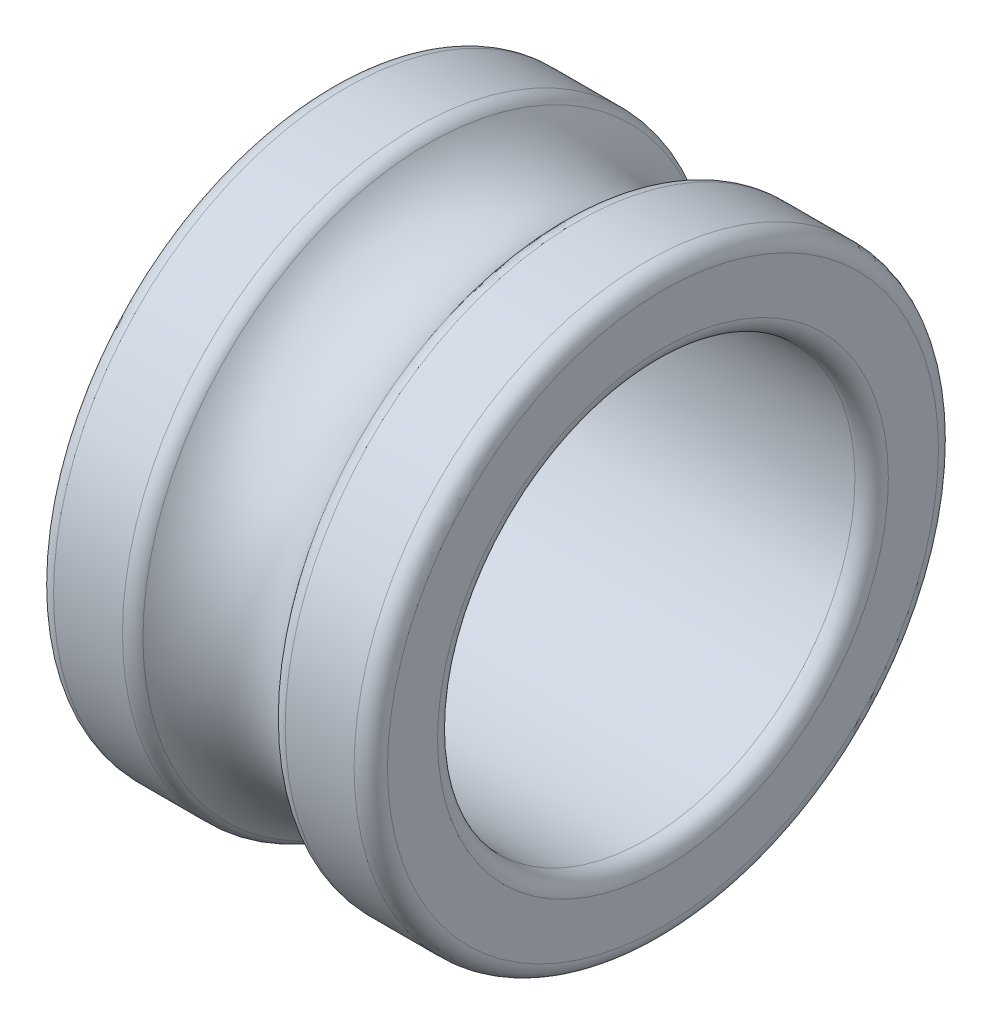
ISO-10303-21;
HEADER;
FILE_DESCRIPTION(('STEP AP214'),'2;1');
FILE_NAME('part.step','',(''),(''),'','','');
FILE_SCHEMA(('AUTOMOTIVE_DESIGN { 1 0 10303 214 1 1 1 1 }'));
ENDSEC;
DATA;
#1=APPLICATION_CONTEXT('core data for automotive mechanical design processes');
#2=APPLICATION_PROTOCOL_DEFINITION('international standard','automotive_design',2000,#1);
#3=PRODUCT_CONTEXT('',#1,'mechanical');
#4=PRODUCT('Part','Part','',(#3));
#5=PRODUCT_RELATED_PRODUCT_CATEGORY('part','',(#4));
#6=PRODUCT_DEFINITION_FORMATION('','',#4);
#7=PRODUCT_DEFINITION_CONTEXT('part definition',#1,'design');
#8=PRODUCT_DEFINITION('design','',#6,#7);
#9=PRODUCT_DEFINITION_SHAPE('','',#8);
#10=(LENGTH_UNIT() NAMED_UNIT(*) SI_UNIT(.MILLI.,.METRE.));
#11=(NAMED_UNIT(*) PLANE_ANGLE_UNIT() SI_UNIT($,.RADIAN.));
#12=(NAMED_UNIT(*) SI_UNIT($,.STERADIAN.) SOLID_ANGLE_UNIT());
#13=UNCERTAINTY_MEASURE_WITH_UNIT(LENGTH_MEASURE(1.E-05),#10,'distance_accuracy_value','');
#14=(GEOMETRIC_REPRESENTATION_CONTEXT(3) GLOBAL_UNCERTAINTY_ASSIGNED_CONTEXT((#13)) GLOBAL_UNIT_ASSIGNED_CONTEXT((#10,
#11,#12)) REPRESENTATION_CONTEXT('',''));
#15=CARTESIAN_POINT('',(0.,0.,0.));
#16=DIRECTION('',(0.,0.,1.));
#17=DIRECTION('',(1.,0.,0.));
#18=AXIS2_PLACEMENT_3D('',#15,#16,#17);
#19=CARTESIAN_POINT('',(-2.,2.5,0.));
#20=DIRECTION('',(1.,0.,0.));
#21=DIRECTION('',(0.,0.,-1.));
#22=AXIS2_PLACEMENT_3D('',#19,#20,#21);
#23=PLANE('',#22);
#24=CARTESIAN_POINT('',(-2.,0.,0.));
#25=DIRECTION('',(1.,0.,0.));
#26=DIRECTION('',(0.,0.,-1.));
#27=AXIS2_PLACEMENT_3D('',#24,#25,#26);
#28=CIRCLE('',#27,3.3);
#29=CARTESIAN_POINT('',(-2.,0.,-3.3));
#30=VERTEX_POINT('',#29);
#31=EDGE_CURVE('E38',#30,#30,#28,.F.);
#32=ORIENTED_EDGE('',*,*,#31,.T.);
#33=EDGE_LOOP('',(#32));
#34=FACE_BOUND('',#33,.T.);
#35=CARTESIAN_POINT('',(-2.,0.,0.));
#36=DIRECTION('',(1.,0.,0.));
#37=DIRECTION('',(0.,0.,-1.));
#38=AXIS2_PLACEMENT_3D('',#35,#36,#37);
#39=CIRCLE('',#38,2.7);
#40=CARTESIAN_POINT('',(-2.,0.,-2.7));
#41=VERTEX_POINT('',#40);
#42=EDGE_CURVE('E42',#41,#41,#39,.T.);
#43=ORIENTED_EDGE('',*,*,#42,.T.);
#44=EDGE_LOOP('',(#43));
#45=FACE_BOUND('',#44,.T.);
#46=ADVANCED_FACE('F28',(#34,#45),#23,.F.);
#47=CARTESIAN_POINT('',(0.,0.,0.));
#48=DIRECTION('',(-1.,0.,0.));
#49=DIRECTION('',(0.,0.,1.));
#50=AXIS2_PLACEMENT_3D('',#47,#48,#49);
#51=CYLINDRICAL_SURFACE('',#50,2.5);
#52=CARTESIAN_POINT('',(-1.8,0.,0.));
#53=DIRECTION('',(1.,0.,0.));
#54=DIRECTION('',(0.,0.,-1.));
#55=AXIS2_PLACEMENT_3D('',#52,#53,#54);
#56=CIRCLE('',#55,2.5);
#57=CARTESIAN_POINT('',(-1.8,0.,-2.5));
#58=VERTEX_POINT('',#57);
#59=EDGE_CURVE('E10',#58,#58,#56,.F.);
#60=ORIENTED_EDGE('',*,*,#59,.T.);
#61=EDGE_LOOP('',(#60));
#62=FACE_BOUND('',#61,.T.);
#63=CARTESIAN_POINT('',(1.8,0.,0.));
#64=DIRECTION('',(-1.,0.,0.));
#65=DIRECTION('',(0.,0.,1.));
#66=AXIS2_PLACEMENT_3D('',#63,#64,#65);
#67=CIRCLE('',#66,2.5);
#68=CARTESIAN_POINT('',(1.8,0.,2.5));
#69=VERTEX_POINT('',#68);
#70=EDGE_CURVE('E34',#69,#69,#67,.F.);
#71=ORIENTED_EDGE('',*,*,#70,.T.);
#72=EDGE_LOOP('',(#71));
#73=FACE_BOUND('',#72,.T.);
#74=ADVANCED_FACE('F108',(#62,#73),#51,.F.);
#75=CARTESIAN_POINT('',(2.,2.5,0.));
#76=DIRECTION('',(-1.,0.,0.));
#77=DIRECTION('',(0.,0.,1.));
#78=AXIS2_PLACEMENT_3D('',#75,#76,#77);
#79=PLANE('',#78);
#80=CARTESIAN_POINT('',(2.,0.,0.));
#81=DIRECTION('',(-1.,0.,0.));
#82=DIRECTION('',(0.,0.,1.));
#83=AXIS2_PLACEMENT_3D('',#80,#81,#82);
#84=CIRCLE('',#83,3.3);
#85=CARTESIAN_POINT('',(2.,0.,3.3));
#86=VERTEX_POINT('',#85);
#87=EDGE_CURVE('E59',#86,#86,#84,.F.);
#88=ORIENTED_EDGE('',*,*,#87,.T.);
#89=EDGE_LOOP('',(#88));
#90=FACE_BOUND('',#89,.T.);
#91=CARTESIAN_POINT('',(2.,0.,0.));
#92=DIRECTION('',(-1.,0.,0.));
#93=DIRECTION('',(0.,0.,1.));
#94=AXIS2_PLACEMENT_3D('',#91,#92,#93);
#95=CIRCLE('',#94,2.7);
#96=CARTESIAN_POINT('',(2.,0.,2.7));
#97=VERTEX_POINT('',#96);
#98=EDGE_CURVE('E62',#97,#97,#95,.T.);
#99=ORIENTED_EDGE('',*,*,#98,.T.);
#100=EDGE_LOOP('',(#99));
#101=FACE_BOUND('',#100,.T.);
#102=ADVANCED_FACE('F126',(#90,#101),#79,.F.);
#103=CARTESIAN_POINT('',(0.,0.,0.));
#104=DIRECTION('',(-1.,0.,0.));
#105=DIRECTION('',(0.,0.,1.));
#106=AXIS2_PLACEMENT_3D('',#103,#104,#105);
#107=CYLINDRICAL_SURFACE('',#106,3.5);
#108=CARTESIAN_POINT('',(1.8,0.,0.));
#109=DIRECTION('',(-1.,0.,0.));
#110=DIRECTION('',(0.,0.,1.));
#111=AXIS2_PLACEMENT_3D('',#108,#109,#110);
#112=CIRCLE('',#111,3.5);
#113=CARTESIAN_POINT('',(1.8,0.,3.5));
#114=VERTEX_POINT('',#113);
#115=EDGE_CURVE('E65',#114,#114,#112,.T.);
#116=ORIENTED_EDGE('',*,*,#115,.T.);
#117=EDGE_LOOP('',(#116));
#118=FACE_BOUND('',#117,.T.);
#119=CARTESIAN_POINT('',(0.974679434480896,0.,0.));
#120=DIRECTION('',(1.,0.,0.));
#121=DIRECTION('',(0.,0.,-1.));
#122=AXIS2_PLACEMENT_3D('',#119,#120,#121);
#123=CIRCLE('',#122,3.5);
#124=CARTESIAN_POINT('',(0.974679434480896,0.,-3.5));
#125=VERTEX_POINT('',#124);
#126=EDGE_CURVE('E68',#125,#125,#123,.T.);
#127=ORIENTED_EDGE('',*,*,#126,.T.);
#128=EDGE_LOOP('',(#127));
#129=FACE_BOUND('',#128,.T.);
#130=ADVANCED_FACE('F72',(#118,#129),#107,.T.);
#131=CARTESIAN_POINT('',(0.,0.,0.));
#132=DIRECTION('',(-1.,0.,0.));
#133=DIRECTION('',(0.,0.,1.));
#134=AXIS2_PLACEMENT_3D('',#131,#132,#133);
#135=TOROIDAL_SURFACE('',#134,4.,1.);
#136=CARTESIAN_POINT('',(0.812232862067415,0.,0.));
#137=DIRECTION('',(-1.,0.,0.));
#138=DIRECTION('',(0.,0.,1.));
#139=AXIS2_PLACEMENT_3D('',#136,#137,#138);
#140=CIRCLE('',#139,3.41666666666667);
#141=CARTESIAN_POINT('',(0.812232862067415,0.,3.41666666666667));
#142=VERTEX_POINT('',#141);
#143=EDGE_CURVE('E53',#142,#142,#140,.T.);
#144=ORIENTED_EDGE('',*,*,#143,.T.);
#145=EDGE_LOOP('',(#144));
#146=FACE_BOUND('',#145,.T.);
#147=CARTESIAN_POINT('',(-0.812232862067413,0.,0.));
#148=DIRECTION('',(1.,0.,0.));
#149=DIRECTION('',(0.,0.,-1.));
#150=AXIS2_PLACEMENT_3D('',#147,#148,#149);
#151=CIRCLE('',#150,3.41666666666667);
#152=CARTESIAN_POINT('',(-0.812232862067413,0.,-3.41666666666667));
#153=VERTEX_POINT('',#152);
#154=EDGE_CURVE('E56',#153,#153,#151,.T.);
#155=ORIENTED_EDGE('',*,*,#154,.T.);
#156=EDGE_LOOP('',(#155));
#157=FACE_BOUND('',#156,.T.);
#158=ADVANCED_FACE('F82',(#146,#157),#135,.F.);
#159=CARTESIAN_POINT('',(0.,0.,0.));
#160=DIRECTION('',(-1.,0.,0.));
#161=DIRECTION('',(0.,0.,1.));
#162=AXIS2_PLACEMENT_3D('',#159,#160,#161);
#163=CYLINDRICAL_SURFACE('',#162,3.5);
#164=CARTESIAN_POINT('',(-0.974679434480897,0.,0.));
#165=DIRECTION('',(1.,0.,0.));
#166=DIRECTION('',(0.,0.,-1.));
#167=AXIS2_PLACEMENT_3D('',#164,#165,#166);
#168=CIRCLE('',#167,3.5);
#169=CARTESIAN_POINT('',(-0.974679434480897,0.,-3.5));
#170=VERTEX_POINT('',#169);
#171=EDGE_CURVE('E47',#170,#170,#168,.F.);
#172=ORIENTED_EDGE('',*,*,#171,.T.);
#173=EDGE_LOOP('',(#172));
#174=FACE_BOUND('',#173,.T.);
#175=CARTESIAN_POINT('',(-1.8,0.,0.));
#176=DIRECTION('',(1.,0.,0.));
#177=DIRECTION('',(0.,0.,-1.));
#178=AXIS2_PLACEMENT_3D('',#175,#176,#177);
#179=CIRCLE('',#178,3.5);
#180=CARTESIAN_POINT('',(-1.8,0.,-3.5));
#181=VERTEX_POINT('',#180);
#182=EDGE_CURVE('E50',#181,#181,#179,.T.);
#183=ORIENTED_EDGE('',*,*,#182,.T.);
#184=EDGE_LOOP('',(#183));
#185=FACE_BOUND('',#184,.T.);
#186=ADVANCED_FACE('F85',(#174,#185),#163,.T.);
#187=CARTESIAN_POINT('',(1.8,0.,0.));
#188=DIRECTION('',(-1.,0.,0.));
#189=DIRECTION('',(0.,0.,1.));
#190=AXIS2_PLACEMENT_3D('',#187,#188,#189);
#191=TOROIDAL_SURFACE('',#190,3.3,0.2);
#192=ORIENTED_EDGE('',*,*,#87,.F.);
#193=EDGE_LOOP('',(#192));
#194=FACE_BOUND('',#193,.T.);
#195=ORIENTED_EDGE('',*,*,#115,.F.);
#196=EDGE_LOOP('',(#195));
#197=FACE_BOUND('',#196,.T.);
#198=ADVANCED_FACE('F78',(#194,#197),#191,.T.);
#199=CARTESIAN_POINT('',(0.974679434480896,0.,0.));
#200=DIRECTION('',(1.,0.,0.));
#201=DIRECTION('',(0.,0.,-1.));
#202=AXIS2_PLACEMENT_3D('',#199,#200,#201);
#203=TOROIDAL_SURFACE('',#202,3.3,0.2);
#204=ORIENTED_EDGE('',*,*,#126,.F.);
#205=EDGE_LOOP('',(#204));
#206=FACE_BOUND('',#205,.T.);
#207=ORIENTED_EDGE('',*,*,#143,.F.);
#208=EDGE_LOOP('',(#207));
#209=FACE_BOUND('',#208,.T.);
#210=ADVANCED_FACE('F74',(#206,#209),#203,.T.);
#211=CARTESIAN_POINT('',(-0.974679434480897,0.,0.));
#212=DIRECTION('',(1.,0.,0.));
#213=DIRECTION('',(0.,0.,-1.));
#214=AXIS2_PLACEMENT_3D('',#211,#212,#213);
#215=TOROIDAL_SURFACE('',#214,3.3,0.2);
#216=ORIENTED_EDGE('',*,*,#154,.F.);
#217=EDGE_LOOP('',(#216));
#218=FACE_BOUND('',#217,.T.);
#219=ORIENTED_EDGE('',*,*,#171,.F.);
#220=EDGE_LOOP('',(#219));
#221=FACE_BOUND('',#220,.T.);
#222=ADVANCED_FACE('F77',(#218,#221),#215,.T.);
#223=CARTESIAN_POINT('',(-1.8,0.,0.));
#224=DIRECTION('',(1.,0.,0.));
#225=DIRECTION('',(0.,0.,-1.));
#226=AXIS2_PLACEMENT_3D('',#223,#224,#225);
#227=TOROIDAL_SURFACE('',#226,3.3,0.2);
#228=ORIENTED_EDGE('',*,*,#182,.F.);
#229=EDGE_LOOP('',(#228));
#230=FACE_BOUND('',#229,.T.);
#231=ORIENTED_EDGE('',*,*,#31,.F.);
#232=EDGE_LOOP('',(#231));
#233=FACE_BOUND('',#232,.T.);
#234=ADVANCED_FACE('F91',(#230,#233),#227,.T.);
#235=CARTESIAN_POINT('',(-1.8,0.,0.));
#236=DIRECTION('',(1.,0.,0.));
#237=DIRECTION('',(0.,0.,-1.));
#238=AXIS2_PLACEMENT_3D('',#235,#236,#237);
#239=TOROIDAL_SURFACE('',#238,2.7,0.2);
#240=ORIENTED_EDGE('',*,*,#42,.F.);
#241=EDGE_LOOP('',(#240));
#242=FACE_BOUND('',#241,.T.);
#243=ORIENTED_EDGE('',*,*,#59,.F.);
#244=EDGE_LOOP('',(#243));
#245=FACE_BOUND('',#244,.T.);
#246=ADVANCED_FACE('F102',(#242,#245),#239,.T.);
#247=CARTESIAN_POINT('',(1.8,0.,0.));
#248=DIRECTION('',(-1.,0.,0.));
#249=DIRECTION('',(0.,0.,1.));
#250=AXIS2_PLACEMENT_3D('',#247,#248,#249);
#251=TOROIDAL_SURFACE('',#250,2.7,0.2);
#252=ORIENTED_EDGE('',*,*,#70,.F.);
#253=EDGE_LOOP('',(#252));
#254=FACE_BOUND('',#253,.T.);
#255=ORIENTED_EDGE('',*,*,#98,.F.);
#256=EDGE_LOOP('',(#255));
#257=FACE_BOUND('',#256,.T.);
#258=ADVANCED_FACE('F113',(#254,#257),#251,.T.);
#259=CLOSED_SHELL('',(#46,#74,#102,#130,#158,#186,#198,#210,#222,#234,#246,#258));
#260=MANIFOLD_SOLID_BREP('B2',#259);
#261=ADVANCED_BREP_SHAPE_REPRESENTATION('',(#18,#260),#14);
#262=SHAPE_DEFINITION_REPRESENTATION(#9,#261);
ENDSEC;
END-ISO-10303-21;
